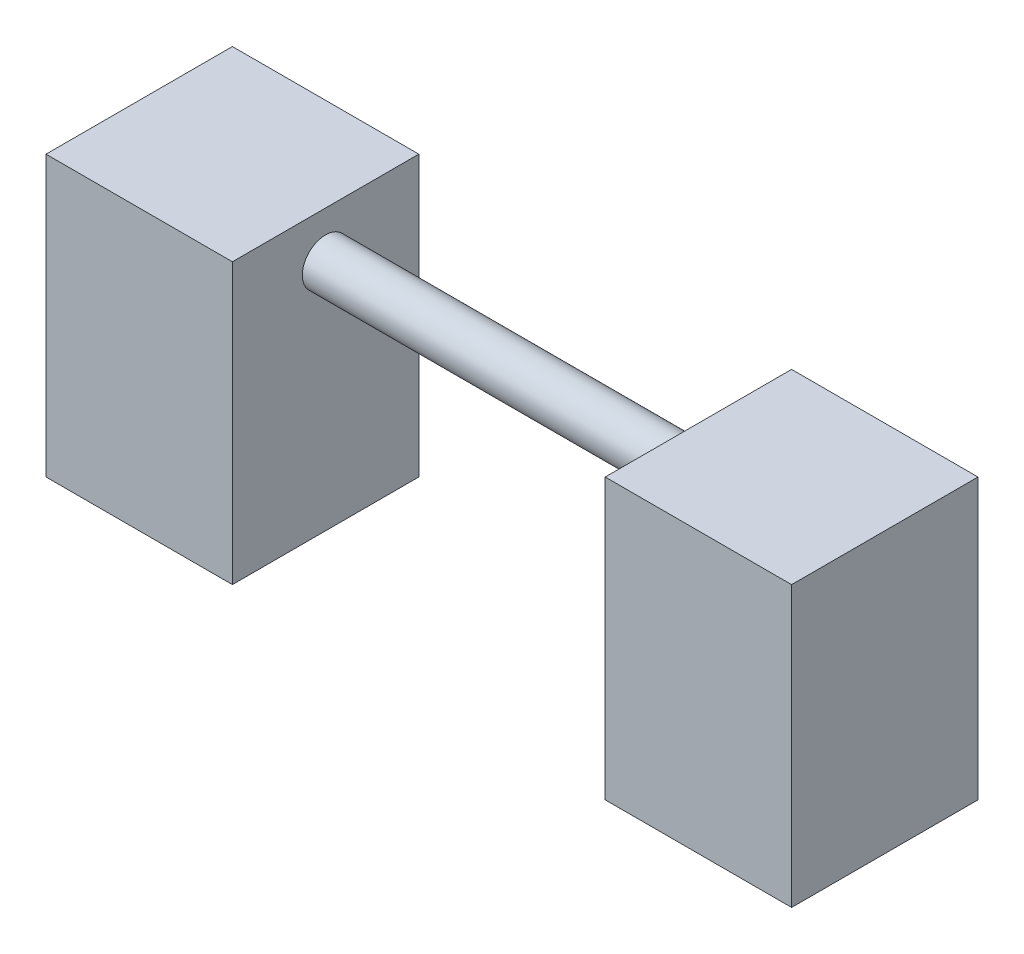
from build123d import *

# Parameters (mm, degrees)
SKETCH1_W                = 40
SKETCH1_H                = 40
BOSS_EXTRUDE1_DEPTH      = 60
BOSS_EXTRUDE1_2_DEPTH    = 60
BOSS_EXTRUDE2_DEPTH      = 80
BOSS_EXTRUDE2_DEPTH_BACK = 40
SKETCH2_R                = 5


with BuildPart() as part:
    # Sketch1 → Boss-Extrude1 (new body)
    with BuildSketch(Plane(origin=(0, 0, 0), x_dir=(1, 0, 0), z_dir=(0, 1, 0))):
        with Locations((-60, 0)):
            Rectangle(SKETCH1_W, SKETCH1_H)
    extrude(amount=BOSS_EXTRUDE1_DEPTH)



with BuildPart() as body_2:
    # Sketch1 → Boss-Extrude1 2 (new body)
    with BuildSketch(Plane(origin=(0, 0, 0), x_dir=(1, 0, 0), z_dir=(0, 1, 0))):
        with Locations((60, 0)):
            Rectangle(SKETCH1_W, SKETCH1_H)
    extrude(amount=BOSS_EXTRUDE1_2_DEPTH)


with BuildPart() as part_1:
    add(part.part)

    add(body_2.part)  # Boss-Extrude2 merges body 2
    # Sketch2 → Boss-Extrude2 (add, two sides: drawn at the far end of the back side and taken through both)
    with BuildSketch(Plane(origin=(0, 0, 0), x_dir=(0, 0, -1), z_dir=(1, 0, 0)).offset(-BOSS_EXTRUDE2_DEPTH_BACK)):
        with Locations((0, 50)):
            Circle(SKETCH2_R)
    extrude(amount=BOSS_EXTRUDE2_DEPTH + BOSS_EXTRUDE2_DEPTH_BACK)


solid = part_1.part
